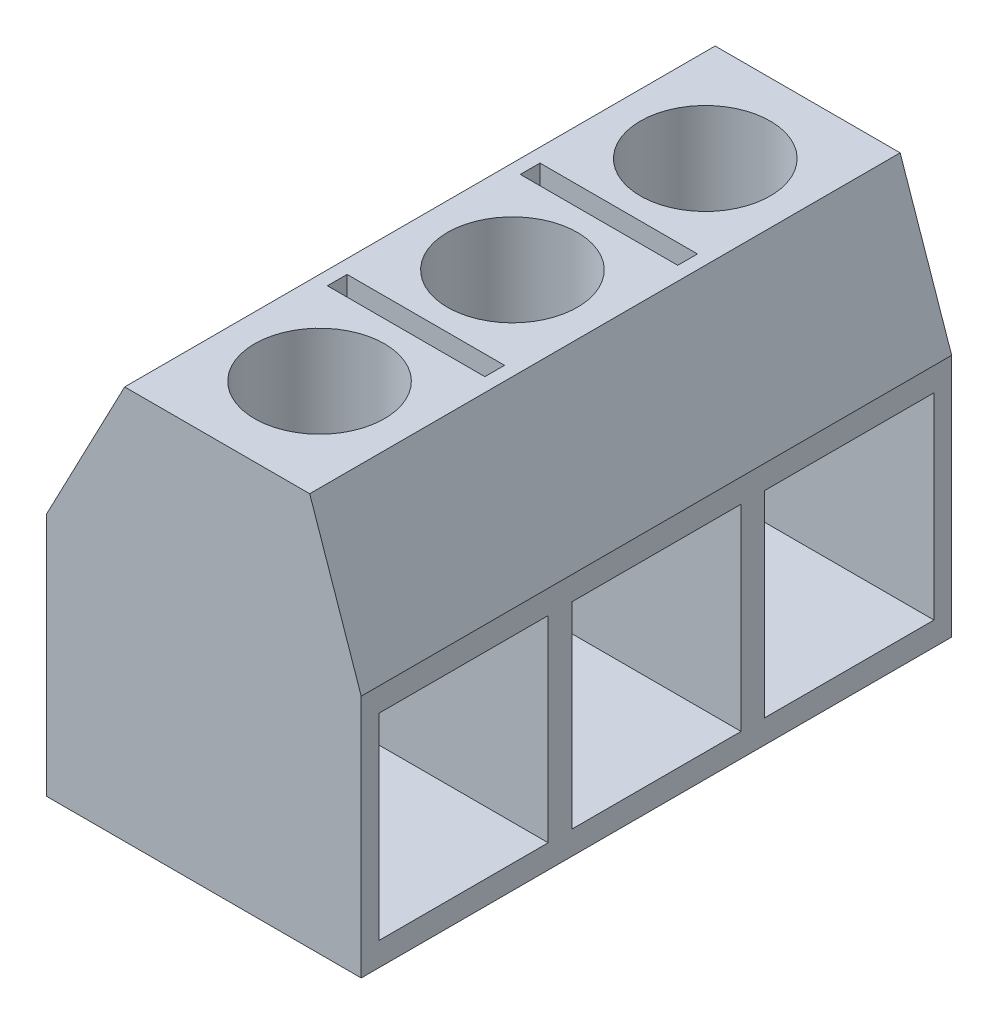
from build123d import *

# Parameters (mm, degrees)
BOSS_EXTRUDE1_DEPTH = 15
SKETCH2_R           = 1.65
SKETCH2_W           = 4
SKETCH2_H           = 0.5
CUT_EXTRUDE1_DEPTH  = 9.2
SKETCH3_W           = 4.3
SKETCH3_H           = 5
CUT_EXTRUDE2_DEPTH  = 6


with BuildPart() as part:
    # Sketch1 → Boss-Extrude1 (new body)
    with BuildSketch(Plane.XY):
        Polygon((-3.803278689, 0), (4.196721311, 0), (4.196721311, 6.2), (2.887726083, 10), (-1.812273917, 10), (-3.803278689, 6.2), align=None)
    extrude(amount=BOSS_EXTRUDE1_DEPTH)

    # Sketch2 → Cut-Extrude1 (cut)
    with BuildSketch(Plane(origin=(0, 10, 0), x_dir=(1, 0, 0), z_dir=(0, 1, 0))):
        with Locations(Location((0.537726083, -12.4, 0), (0, 0, 180))):
            Circle(SKETCH2_R)
        with Locations(Location((0.537726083, -7.5, 0), (0, 0, 180))):
            Circle(SKETCH2_R)
        with Locations(Location((0.537726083, -2.6, 0), (0, 0, 180))):
            Circle(SKETCH2_R)
        with Locations((0.537726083, -9.95)):
            Rectangle(SKETCH2_W, SKETCH2_H)
        with Locations((0.537726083, -5.05)):
            Rectangle(SKETCH2_W, SKETCH2_H)
    extrude(amount=-CUT_EXTRUDE1_DEPTH, mode=Mode.SUBTRACT)

    # Sketch3 → Cut-Extrude2 (cut)
    with BuildSketch(Plane(origin=(4.196721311, 0, 0), x_dir=(0, 0, -1), z_dir=(1, 0, 0))):
        with Locations((-12.4, 3.1)):
            Rectangle(SKETCH3_W, SKETCH3_H)
        with Locations((-7.5, 3.1)):
            Rectangle(SKETCH3_W, SKETCH3_H)
        with Locations((-2.6, 3.1)):
            Rectangle(SKETCH3_W, SKETCH3_H)
    extrude(amount=-CUT_EXTRUDE2_DEPTH, mode=Mode.SUBTRACT)


solid = part.part
